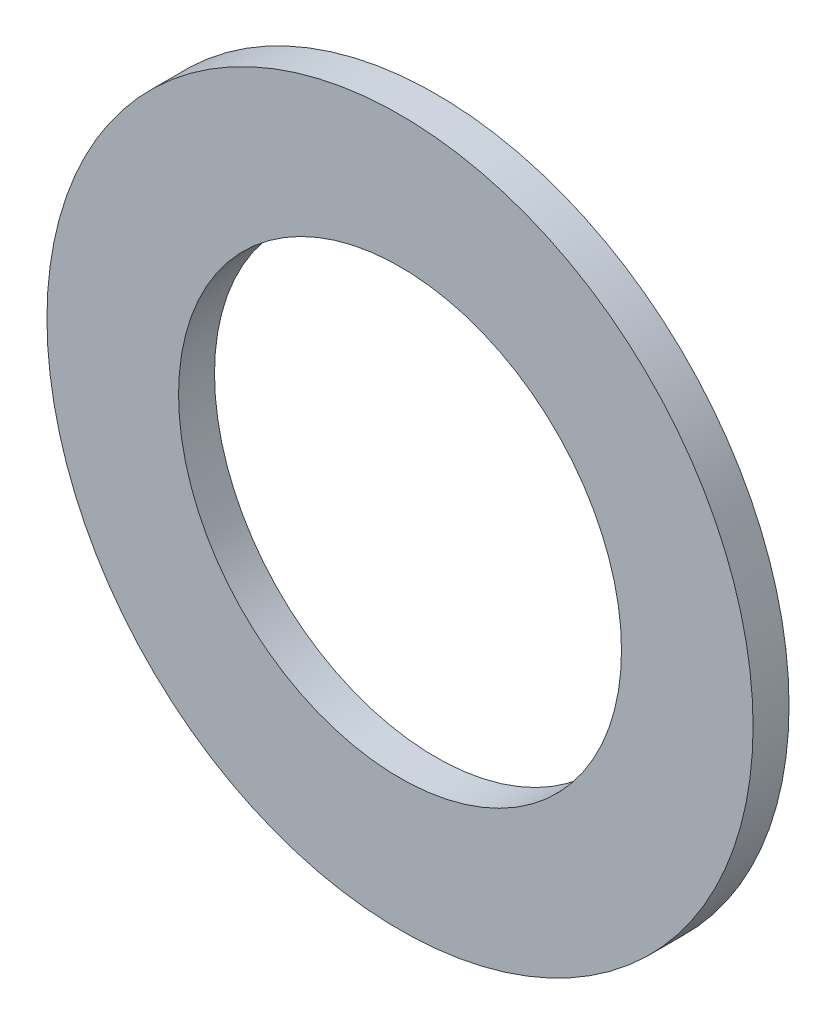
from build123d import *

# Parameters (mm, degrees)
SKETCH1_R      = 15.58925
SKETCH1_R_2    = 9.779
EXTRUDE1_DEPTH = 1.5875


with BuildPart() as part:
    # Sketch1 → Extrude1 (new body)
    with BuildSketch(Plane.XY):
        Circle(SKETCH1_R)
        Circle(SKETCH1_R_2, mode=Mode.SUBTRACT)
    extrude(amount=EXTRUDE1_DEPTH)


solid = part.part
